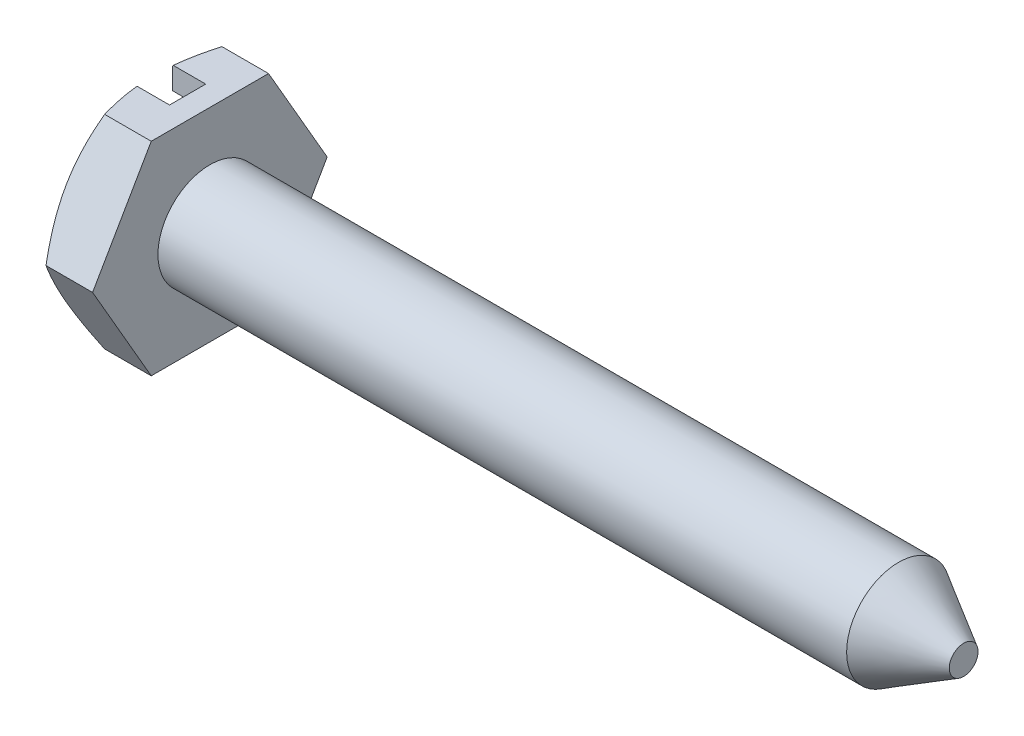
ISO-10303-21;
HEADER;
FILE_DESCRIPTION(('STEP AP214'),'2;1');
FILE_NAME('part.step','',(''),(''),'','','');
FILE_SCHEMA(('AUTOMOTIVE_DESIGN { 1 0 10303 214 1 1 1 1 }'));
ENDSEC;
DATA;
#1=APPLICATION_CONTEXT('core data for automotive mechanical design processes');
#2=APPLICATION_PROTOCOL_DEFINITION('international standard','automotive_design',2000,#1);
#3=PRODUCT_CONTEXT('',#1,'mechanical');
#4=PRODUCT('Part','Part','',(#3));
#5=PRODUCT_RELATED_PRODUCT_CATEGORY('part','',(#4));
#6=PRODUCT_DEFINITION_FORMATION('','',#4);
#7=PRODUCT_DEFINITION_CONTEXT('part definition',#1,'design');
#8=PRODUCT_DEFINITION('design','',#6,#7);
#9=PRODUCT_DEFINITION_SHAPE('','',#8);
#10=(LENGTH_UNIT() NAMED_UNIT(*) SI_UNIT(.MILLI.,.METRE.));
#11=(NAMED_UNIT(*) PLANE_ANGLE_UNIT() SI_UNIT($,.RADIAN.));
#12=(NAMED_UNIT(*) SI_UNIT($,.STERADIAN.) SOLID_ANGLE_UNIT());
#13=UNCERTAINTY_MEASURE_WITH_UNIT(LENGTH_MEASURE(1.E-05),#10,'distance_accuracy_value','');
#14=(GEOMETRIC_REPRESENTATION_CONTEXT(3) GLOBAL_UNCERTAINTY_ASSIGNED_CONTEXT((#13)) GLOBAL_UNIT_ASSIGNED_CONTEXT((#10,
#11,#12)) REPRESENTATION_CONTEXT('',''));
#15=CARTESIAN_POINT('',(0.,0.,0.));
#16=DIRECTION('',(0.,0.,1.));
#17=DIRECTION('',(1.,0.,0.));
#18=AXIS2_PLACEMENT_3D('',#15,#16,#17);
#19=CARTESIAN_POINT('',(0.,0.,0.));
#20=DIRECTION('',(-1.,0.,0.));
#21=DIRECTION('',(0.,0.,1.));
#22=AXIS2_PLACEMENT_3D('',#19,#20,#21);
#23=CYLINDRICAL_SURFACE('',#22,1.4224);
#24=CARTESIAN_POINT('',(0.,0.,0.));
#25=DIRECTION('',(-1.,0.,0.));
#26=DIRECTION('',(0.,0.,1.));
#27=AXIS2_PLACEMENT_3D('',#24,#25,#26);
#28=CIRCLE('',#27,1.4224);
#29=CARTESIAN_POINT('',(0.,0.,1.4224));
#30=VERTEX_POINT('',#29);
#31=EDGE_CURVE('E445',#30,#30,#28,.T.);
#32=ORIENTED_EDGE('',*,*,#31,.F.);
#33=EDGE_LOOP('',(#32));
#34=FACE_BOUND('',#33,.T.);
#35=CARTESIAN_POINT('',(18.8557393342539,0.,0.));
#36=DIRECTION('',(-1.,0.,0.));
#37=DIRECTION('',(0.,0.,1.));
#38=AXIS2_PLACEMENT_3D('',#35,#36,#37);
#39=CIRCLE('',#38,1.4224);
#40=CARTESIAN_POINT('',(18.8557393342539,0.,1.4224));
#41=VERTEX_POINT('',#40);
#42=EDGE_CURVE('E628',#41,#41,#39,.T.);
#43=ORIENTED_EDGE('',*,*,#42,.T.);
#44=EDGE_LOOP('',(#43));
#45=FACE_BOUND('',#44,.T.);
#46=ADVANCED_FACE('F81',(#34,#45),#23,.T.);
#47=CARTESIAN_POINT('',(-0.6096,-2.7813,0.4953));
#48=DIRECTION('',(0.,0.,1.));
#49=DIRECTION('',(1.,0.,0.));
#50=AXIS2_PLACEMENT_3D('',#47,#48,#49);
#51=PLANE('',#50);
#52=DIRECTION('',(-1.,0.,0.));
#53=VECTOR('',#52,1.);
#54=CARTESIAN_POINT('',(0.,2.16921204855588,0.4953));
#55=LINE('',#54,#53);
#56=CARTESIAN_POINT('',(-1.524,2.16921204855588,0.4953));
#57=VERTEX_POINT('',#56);
#58=CARTESIAN_POINT('',(-1.2192,2.16921204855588,0.4953));
#59=VERTEX_POINT('',#58);
#60=EDGE_CURVE('E209',#57,#59,#55,.F.);
#61=ORIENTED_EDGE('',*,*,#60,.F.);
#62=DIRECTION('',(0.,-1.,0.));
#63=VECTOR('',#62,1.);
#64=CARTESIAN_POINT('',(-1.524,2.7813,0.4953));
#65=LINE('',#64,#63);
#66=CARTESIAN_POINT('',(-1.524,2.73684263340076,0.4953));
#67=VERTEX_POINT('',#66);
#68=EDGE_CURVE('E221',#67,#57,#65,.T.);
#69=ORIENTED_EDGE('',*,*,#68,.F.);
#70=CARTESIAN_POINT('',(-2.83951584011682,-0.0862858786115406,0.4953));
#71=CARTESIAN_POINT('',(-2.84181163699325,-0.0633932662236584,0.4953));
#72=CARTESIAN_POINT('',(-2.84318730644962,-0.0404084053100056,0.4953));
#73=CARTESIAN_POINT('',(-2.84410443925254,0.00556449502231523,0.4953));
#74=CARTESIAN_POINT('',(-2.84364857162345,0.0285524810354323,0.4953));
#75=CARTESIAN_POINT('',(-2.84093558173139,0.0740779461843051,0.4953));
#76=CARTESIAN_POINT('',(-2.83870525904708,0.0966170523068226,0.4953));
#77=CARTESIAN_POINT('',(-2.8326528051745,0.141472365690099,0.4953));
#78=CARTESIAN_POINT('',(-2.8288308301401,0.163788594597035,0.4953));
#79=CARTESIAN_POINT('',(-2.81640703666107,0.225017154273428,0.4953));
#80=CARTESIAN_POINT('',(-2.80638094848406,0.263638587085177,0.4953));
#81=CARTESIAN_POINT('',(-2.78343643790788,0.340026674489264,0.4953));
#82=CARTESIAN_POINT('',(-2.77051412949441,0.377792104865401,0.4953));
#83=CARTESIAN_POINT('',(-2.7427005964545,0.452776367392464,0.4953));
#84=CARTESIAN_POINT('',(-2.72780062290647,0.489991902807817,0.4953));
#85=CARTESIAN_POINT('',(-2.69672595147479,0.563856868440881,0.4953));
#86=CARTESIAN_POINT('',(-2.68055191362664,0.600506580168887,0.4953));
#87=CARTESIAN_POINT('',(-2.64666056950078,0.674866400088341,0.4953));
#88=CARTESIAN_POINT('',(-2.62890737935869,0.712560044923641,0.4953));
#89=CARTESIAN_POINT('',(-2.59273785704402,0.787628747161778,0.4953));
#90=CARTESIAN_POINT('',(-2.57432148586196,0.825003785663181,0.4953));
#91=CARTESIAN_POINT('',(-2.51848066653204,0.936558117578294,0.4953));
#92=CARTESIAN_POINT('',(-2.48036048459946,1.01038814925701,0.4953));
#93=CARTESIAN_POINT('',(-2.40373336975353,1.15629246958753,0.4953));
#94=CARTESIAN_POINT('',(-2.36524317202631,1.22837563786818,0.4953));
#95=CARTESIAN_POINT('',(-2.28763926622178,1.37220756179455,0.4953));
#96=CARTESIAN_POINT('',(-2.24852554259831,1.44395630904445,0.4953));
#97=CARTESIAN_POINT('',(-2.1305835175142,1.65888463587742,0.4953));
#98=CARTESIAN_POINT('',(-2.05115956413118,1.80173656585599,0.4953));
#99=CARTESIAN_POINT('',(-1.89143009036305,2.08720749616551,0.4953));
#100=CARTESIAN_POINT('',(-1.81112349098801,2.22982588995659,0.4953));
#101=CARTESIAN_POINT('',(-1.65006480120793,2.51480357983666,0.4953));
#102=CARTESIAN_POINT('',(-1.56931272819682,2.65716288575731,0.4953));
#103=CARTESIAN_POINT('',(-1.41917076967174,2.92125266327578,0.4953));
#104=CARTESIAN_POINT('',(-1.34981779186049,3.0430041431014,0.4953));
#105=CARTESIAN_POINT('',(-1.21096785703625,3.28642693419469,0.4953));
#106=CARTESIAN_POINT('',(-1.14147089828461,3.4080982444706,0.4953));
#107=CARTESIAN_POINT('',(-1.00247417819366,3.65120645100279,0.4953));
#108=CARTESIAN_POINT('',(-0.932974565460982,3.77264343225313,0.4953));
#109=CARTESIAN_POINT('',(-0.793897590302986,4.01547078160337,0.4953));
#110=CARTESIAN_POINT('',(-0.724320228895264,4.13686115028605,0.4953));
#111=CARTESIAN_POINT('',(-0.654715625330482,4.25823587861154,0.4953));
#112=B_SPLINE_CURVE_WITH_KNOTS('',3,(#70,#71,#72,#73,#74,#75,#76,#77,#78,#79,#80,#81,#82,#83,
#84,#85,#86,#87,#88,#89,#90,#91,#92,#93,#94,#95,#96,#97,#98,#99,#100,#101,#102,#103,#104,#105,
#106,#107,#108,#109,#110,#111),.UNSPECIFIED.,.F.,.F.,(4,2,2,2,2,2,2,2,2,2,2,2,2,2,2,2,2,2,2,2,
4),(0.,0.0690044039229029,0.137908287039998,0.205790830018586,0.273666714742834,
0.393183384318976,0.512861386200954,0.633087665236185,0.753252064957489,0.8782383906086,
1.00323208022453,1.25248552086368,1.49762998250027,1.74278056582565,2.23311484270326,
2.72413593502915,3.21513798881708,3.63549409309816,4.05585530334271,4.47561023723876,
4.89535974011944),.UNSPECIFIED.);
#113=CARTESIAN_POINT('',(-1.49873640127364,2.7813,0.4953));
#114=VERTEX_POINT('',#113);
#115=EDGE_CURVE('E327',#67,#114,#112,.T.);
#116=ORIENTED_EDGE('',*,*,#115,.T.);
#117=DIRECTION('',(-1.,0.,0.));
#118=VECTOR('',#117,1.);
#119=CARTESIAN_POINT('',(-0.6096,2.7813,0.4953));
#120=LINE('',#119,#118);
#121=CARTESIAN_POINT('',(-0.6096,2.7813,0.4953));
#122=VERTEX_POINT('',#121);
#123=EDGE_CURVE('E288',#122,#114,#120,.T.);
#124=ORIENTED_EDGE('',*,*,#123,.F.);
#125=DIRECTION('',(0.,1.,0.));
#126=VECTOR('',#125,1.);
#127=CARTESIAN_POINT('',(-0.6096,-2.7813,0.4953));
#128=LINE('',#127,#126);
#129=CARTESIAN_POINT('',(-0.6096,-2.7813,0.4953));
#130=VERTEX_POINT('',#129);
#131=EDGE_CURVE('E275',#130,#122,#128,.T.);
#132=ORIENTED_EDGE('',*,*,#131,.F.);
#133=DIRECTION('',(-1.,0.,0.));
#134=VECTOR('',#133,1.);
#135=CARTESIAN_POINT('',(-0.6096,-2.7813,0.4953));
#136=LINE('',#135,#134);
#137=CARTESIAN_POINT('',(-1.49873640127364,-2.7813,0.4953));
#138=VERTEX_POINT('',#137);
#139=EDGE_CURVE('E287',#130,#138,#136,.T.);
#140=ORIENTED_EDGE('',*,*,#139,.T.);
#141=CARTESIAN_POINT('',(-0.661468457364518,-4.24646055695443,0.4953));
#142=CARTESIAN_POINT('',(-0.778480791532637,-4.04237436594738,0.4953));
#143=CARTESIAN_POINT('',(-0.895440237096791,-3.8382574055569,0.4953));
#144=CARTESIAN_POINT('',(-1.12909036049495,-3.42984774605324,0.4953));
#145=CARTESIAN_POINT('',(-1.24578101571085,-3.22555503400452,0.4953));
#146=CARTESIAN_POINT('',(-1.47737015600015,-2.8190671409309,0.4953));
#147=CARTESIAN_POINT('',(-1.59227380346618,-2.61687490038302,0.4953));
#148=CARTESIAN_POINT('',(-1.82126101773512,-2.21204180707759,0.4953));
#149=CARTESIAN_POINT('',(-1.93534463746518,-2.00940098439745,0.4953));
#150=CARTESIAN_POINT('',(-2.09695482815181,-1.71912566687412,0.4953));
#151=CARTESIAN_POINT('',(-2.14526845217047,-1.63193028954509,0.4953));
#152=CARTESIAN_POINT('',(-2.24132676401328,-1.45721192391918,0.4953));
#153=CARTESIAN_POINT('',(-2.28907137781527,-1.36968889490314,0.4953));
#154=CARTESIAN_POINT('',(-2.38396710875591,-1.19350160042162,0.4953));
#155=CARTESIAN_POINT('',(-2.43111145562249,-1.10483365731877,0.4953));
#156=CARTESIAN_POINT('',(-2.50047993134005,-0.971144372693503,0.4953));
#157=CARTESIAN_POINT('',(-2.5233753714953,-0.926472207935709,0.4953));
#158=CARTESIAN_POINT('',(-2.56851466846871,-0.836800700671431,0.4953));
#159=CARTESIAN_POINT('',(-2.5907585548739,-0.791801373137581,0.4953));
#160=CARTESIAN_POINT('',(-2.63241940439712,-0.705206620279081,0.4953));
#161=CARTESIAN_POINT('',(-2.65191539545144,-0.663649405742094,0.4953));
#162=CARTESIAN_POINT('',(-2.68970979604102,-0.579963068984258,0.4953));
#163=CARTESIAN_POINT('',(-2.70800762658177,-0.537833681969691,0.4953));
#164=CARTESIAN_POINT('',(-2.74252768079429,-0.453285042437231,0.4953));
#165=CARTESIAN_POINT('',(-2.75877123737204,-0.410874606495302,0.4953));
#166=CARTESIAN_POINT('',(-2.78832408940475,-0.325037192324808,0.4953));
#167=CARTESIAN_POINT('',(-2.80163595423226,-0.281611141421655,0.4953));
#168=CARTESIAN_POINT('',(-2.81891829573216,-0.212376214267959,0.4953));
#169=CARTESIAN_POINT('',(-2.82445043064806,-0.18696239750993,0.4953));
#170=CARTESIAN_POINT('',(-2.83360220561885,-0.135800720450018,0.4953));
#171=CARTESIAN_POINT('',(-2.83722314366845,-0.11005309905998,0.4953));
#172=CARTESIAN_POINT('',(-2.84226342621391,-0.0578667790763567,0.4953));
#173=CARTESIAN_POINT('',(-2.84364179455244,-0.0314240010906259,0.4953));
#174=CARTESIAN_POINT('',(-2.84397526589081,0.0215503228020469,0.4953));
#175=CARTESIAN_POINT('',(-2.84292349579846,0.0480819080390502,0.4953));
#176=CARTESIAN_POINT('',(-2.84060505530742,0.0745105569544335,0.4953));
#177=B_SPLINE_CURVE_WITH_KNOTS('',3,(#141,#142,#143,#144,#145,#146,#147,#148,#149,#150,#151,
#152,#153,#154,#155,#156,#157,#158,#159,#160,#161,#162,#163,#164,#165,#166,#167,#168,#169,#170,
#171,#172,#173,#174,#175,#176),.UNSPECIFIED.,.F.,.F.,(4,2,2,2,2,2,2,2,2,2,2,2,2,2,2,2,2,4),(0.,
0.705753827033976,1.41156501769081,2.1092473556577,2.80688425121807,3.10593979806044,
3.4050338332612,3.70628648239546,3.85687606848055,4.00745880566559,4.14515661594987,
4.28292048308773,4.41910977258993,4.5551792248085,4.6331486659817,4.7110650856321,
4.79038982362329,4.86993918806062),.UNSPECIFIED.);
#178=CARTESIAN_POINT('',(-1.524,-2.73684263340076,0.4953));
#179=VERTEX_POINT('',#178);
#180=EDGE_CURVE('E337',#138,#179,#177,.T.);
#181=ORIENTED_EDGE('',*,*,#180,.T.);
#182=CARTESIAN_POINT('',(-1.524,-2.16921204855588,0.4953));
#183=VERTEX_POINT('',#182);
#184=EDGE_CURVE('E231',#183,#179,#65,.T.);
#185=ORIENTED_EDGE('',*,*,#184,.F.);
#186=DIRECTION('',(-1.,0.,0.));
#187=VECTOR('',#186,1.);
#188=CARTESIAN_POINT('',(0.,-2.16921204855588,0.4953));
#189=LINE('',#188,#187);
#190=CARTESIAN_POINT('',(-1.2192,-2.16921204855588,0.4953));
#191=VERTEX_POINT('',#190);
#192=EDGE_CURVE('E213',#191,#183,#189,.T.);
#193=ORIENTED_EDGE('',*,*,#192,.F.);
#194=DIRECTION('',(0.,-1.,0.));
#195=VECTOR('',#194,1.);
#196=CARTESIAN_POINT('',(-1.2192,-2.7813,0.4953));
#197=LINE('',#196,#195);
#198=EDGE_CURVE('E223',#59,#191,#197,.T.);
#199=ORIENTED_EDGE('',*,*,#198,.F.);
#200=EDGE_LOOP('',(#61,#69,#116,#124,#132,#140,#181,#185,#193,#199));
#201=FACE_BOUND('',#200,.T.);
#202=ADVANCED_FACE('F217',(#201),#51,.F.);
#203=CARTESIAN_POINT('',(-0.6096,-2.7813,-0.4953));
#204=DIRECTION('',(0.,0.,-1.));
#205=DIRECTION('',(-1.,0.,0.));
#206=AXIS2_PLACEMENT_3D('',#203,#204,#205);
#207=PLANE('',#206);
#208=DIRECTION('',(-1.,0.,0.));
#209=VECTOR('',#208,1.);
#210=CARTESIAN_POINT('',(0.,-2.16921204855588,-0.4953));
#211=LINE('',#210,#209);
#212=CARTESIAN_POINT('',(-1.524,-2.16921204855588,-0.4953));
#213=VERTEX_POINT('',#212);
#214=CARTESIAN_POINT('',(-1.2192,-2.16921204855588,-0.4953));
#215=VERTEX_POINT('',#214);
#216=EDGE_CURVE('E55',#213,#215,#211,.F.);
#217=ORIENTED_EDGE('',*,*,#216,.F.);
#218=DIRECTION('',(0.,1.,0.));
#219=VECTOR('',#218,1.);
#220=CARTESIAN_POINT('',(-1.524,2.7813,-0.4953));
#221=LINE('',#220,#219);
#222=CARTESIAN_POINT('',(-1.524,-2.73684263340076,-0.4953));
#223=VERTEX_POINT('',#222);
#224=EDGE_CURVE('E241',#223,#213,#221,.T.);
#225=ORIENTED_EDGE('',*,*,#224,.F.);
#226=CARTESIAN_POINT('',(-2.83951584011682,0.0862858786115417,-0.4953));
#227=CARTESIAN_POINT('',(-2.84181163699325,0.0633932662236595,-0.4953));
#228=CARTESIAN_POINT('',(-2.84318730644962,0.0404084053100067,-0.4953));
#229=CARTESIAN_POINT('',(-2.84410443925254,-0.00556449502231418,-0.4953));
#230=CARTESIAN_POINT('',(-2.84364857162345,-0.0285524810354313,-0.4953));
#231=CARTESIAN_POINT('',(-2.84093558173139,-0.0740779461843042,-0.4953));
#232=CARTESIAN_POINT('',(-2.83870525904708,-0.0966170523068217,-0.4953));
#233=CARTESIAN_POINT('',(-2.8326528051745,-0.141472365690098,-0.4953));
#234=CARTESIAN_POINT('',(-2.8288308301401,-0.163788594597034,-0.4953));
#235=CARTESIAN_POINT('',(-2.81640703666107,-0.225017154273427,-0.4953));
#236=CARTESIAN_POINT('',(-2.80638094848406,-0.263638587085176,-0.4953));
#237=CARTESIAN_POINT('',(-2.78343643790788,-0.340026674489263,-0.4953));
#238=CARTESIAN_POINT('',(-2.77051412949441,-0.377792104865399,-0.4953));
#239=CARTESIAN_POINT('',(-2.7427005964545,-0.452776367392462,-0.4953));
#240=CARTESIAN_POINT('',(-2.72780062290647,-0.489991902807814,-0.4953));
#241=CARTESIAN_POINT('',(-2.6967259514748,-0.563856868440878,-0.4953));
#242=CARTESIAN_POINT('',(-2.68055191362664,-0.600506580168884,-0.4953));
#243=CARTESIAN_POINT('',(-2.64666056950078,-0.674866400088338,-0.4953));
#244=CARTESIAN_POINT('',(-2.62890737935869,-0.712560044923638,-0.4953));
#245=CARTESIAN_POINT('',(-2.59273785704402,-0.787628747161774,-0.4953));
#246=CARTESIAN_POINT('',(-2.57432148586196,-0.825003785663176,-0.4953));
#247=CARTESIAN_POINT('',(-2.51848066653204,-0.936558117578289,-0.4953));
#248=CARTESIAN_POINT('',(-2.48036048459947,-1.01038814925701,-0.4953));
#249=CARTESIAN_POINT('',(-2.40373336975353,-1.15629246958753,-0.4953));
#250=CARTESIAN_POINT('',(-2.36524317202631,-1.22837563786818,-0.4953));
#251=CARTESIAN_POINT('',(-2.28763926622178,-1.37220756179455,-0.4953));
#252=CARTESIAN_POINT('',(-2.24852554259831,-1.44395630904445,-0.4953));
#253=CARTESIAN_POINT('',(-2.1305835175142,-1.65888463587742,-0.4953));
#254=CARTESIAN_POINT('',(-2.05115956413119,-1.80173656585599,-0.4953));
#255=CARTESIAN_POINT('',(-1.89143009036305,-2.0872074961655,-0.4953));
#256=CARTESIAN_POINT('',(-1.81112349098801,-2.22982588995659,-0.4953));
#257=CARTESIAN_POINT('',(-1.65006480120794,-2.51480357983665,-0.4953));
#258=CARTESIAN_POINT('',(-1.56931272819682,-2.65716288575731,-0.4953));
#259=CARTESIAN_POINT('',(-1.41917076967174,-2.92125266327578,-0.4953));
#260=CARTESIAN_POINT('',(-1.34981779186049,-3.0430041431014,-0.4953));
#261=CARTESIAN_POINT('',(-1.21096785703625,-3.28642693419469,-0.4953));
#262=CARTESIAN_POINT('',(-1.14147089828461,-3.4080982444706,-0.4953));
#263=CARTESIAN_POINT('',(-1.00247417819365,-3.65120645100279,-0.4953));
#264=CARTESIAN_POINT('',(-0.932974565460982,-3.77264343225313,-0.4953));
#265=CARTESIAN_POINT('',(-0.793897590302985,-4.01547078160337,-0.4953));
#266=CARTESIAN_POINT('',(-0.724320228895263,-4.13686115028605,-0.4953));
#267=CARTESIAN_POINT('',(-0.654715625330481,-4.25823587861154,-0.4953));
#268=B_SPLINE_CURVE_WITH_KNOTS('',3,(#226,#227,#228,#229,#230,#231,#232,#233,#234,#235,#236,
#237,#238,#239,#240,#241,#242,#243,#244,#245,#246,#247,#248,#249,#250,#251,#252,#253,#254,#255,
#256,#257,#258,#259,#260,#261,#262,#263,#264,#265,#266,#267),.UNSPECIFIED.,.F.,.F.,(4,2,2,2,2,2,
2,2,2,2,2,2,2,2,2,2,2,2,2,2,4),(0.,0.069004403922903,0.137908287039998,0.205790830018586,
0.273666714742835,0.393183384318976,0.512861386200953,0.633087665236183,0.753252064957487,
0.878238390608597,1.00323208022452,1.25248552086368,1.49762998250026,1.74278056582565,
2.23311484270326,2.72413593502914,3.21513798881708,3.63549409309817,4.05585530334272,
4.47561023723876,4.89535974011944),.UNSPECIFIED.);
#269=CARTESIAN_POINT('',(-1.49873640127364,-2.7813,-0.4953));
#270=VERTEX_POINT('',#269);
#271=EDGE_CURVE('E311',#223,#270,#268,.T.);
#272=ORIENTED_EDGE('',*,*,#271,.T.);
#273=DIRECTION('',(-1.,0.,0.));
#274=VECTOR('',#273,1.);
#275=CARTESIAN_POINT('',(-0.6096,-2.7813,-0.4953));
#276=LINE('',#275,#274);
#277=CARTESIAN_POINT('',(-0.6096,-2.7813,-0.4953));
#278=VERTEX_POINT('',#277);
#279=EDGE_CURVE('E291',#278,#270,#276,.T.);
#280=ORIENTED_EDGE('',*,*,#279,.F.);
#281=DIRECTION('',(0.,-1.,0.));
#282=VECTOR('',#281,1.);
#283=CARTESIAN_POINT('',(-0.6096,-2.7813,-0.4953));
#284=LINE('',#283,#282);
#285=CARTESIAN_POINT('',(-0.6096,2.7813,-0.4953));
#286=VERTEX_POINT('',#285);
#287=EDGE_CURVE('E277',#286,#278,#284,.T.);
#288=ORIENTED_EDGE('',*,*,#287,.F.);
#289=DIRECTION('',(-1.,0.,0.));
#290=VECTOR('',#289,1.);
#291=CARTESIAN_POINT('',(-0.6096,2.7813,-0.4953));
#292=LINE('',#291,#290);
#293=CARTESIAN_POINT('',(-1.49873640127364,2.7813,-0.4953));
#294=VERTEX_POINT('',#293);
#295=EDGE_CURVE('E300',#286,#294,#292,.T.);
#296=ORIENTED_EDGE('',*,*,#295,.T.);
#297=CARTESIAN_POINT('',(-0.661468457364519,4.24646055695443,-0.4953));
#298=CARTESIAN_POINT('',(-0.778480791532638,4.04237436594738,-0.4953));
#299=CARTESIAN_POINT('',(-0.895440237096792,3.8382574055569,-0.4953));
#300=CARTESIAN_POINT('',(-1.12909036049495,3.42984774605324,-0.4953));
#301=CARTESIAN_POINT('',(-1.24578101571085,3.22555503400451,-0.4953));
#302=CARTESIAN_POINT('',(-1.47737015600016,2.8190671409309,-0.4953));
#303=CARTESIAN_POINT('',(-1.59227380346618,2.61687490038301,-0.4953));
#304=CARTESIAN_POINT('',(-1.82126101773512,2.21204180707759,-0.4953));
#305=CARTESIAN_POINT('',(-1.93534463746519,2.00940098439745,-0.4953));
#306=CARTESIAN_POINT('',(-2.09695482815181,1.71912566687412,-0.4953));
#307=CARTESIAN_POINT('',(-2.14526845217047,1.63193028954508,-0.4953));
#308=CARTESIAN_POINT('',(-2.24132676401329,1.45721192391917,-0.4953));
#309=CARTESIAN_POINT('',(-2.28907137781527,1.36968889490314,-0.4953));
#310=CARTESIAN_POINT('',(-2.38396710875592,1.19350160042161,-0.4953));
#311=CARTESIAN_POINT('',(-2.43111145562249,1.10483365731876,-0.4953));
#312=CARTESIAN_POINT('',(-2.50047993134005,0.971144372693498,-0.4953));
#313=CARTESIAN_POINT('',(-2.5233753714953,0.926472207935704,-0.4953));
#314=CARTESIAN_POINT('',(-2.56851466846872,0.836800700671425,-0.4953));
#315=CARTESIAN_POINT('',(-2.5907585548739,0.791801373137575,-0.4953));
#316=CARTESIAN_POINT('',(-2.63241940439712,0.705206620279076,-0.4953));
#317=CARTESIAN_POINT('',(-2.65191539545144,0.663649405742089,-0.4953));
#318=CARTESIAN_POINT('',(-2.68970979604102,0.579963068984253,-0.4953));
#319=CARTESIAN_POINT('',(-2.70800762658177,0.537833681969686,-0.4953));
#320=CARTESIAN_POINT('',(-2.7425276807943,0.453285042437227,-0.4953));
#321=CARTESIAN_POINT('',(-2.75877123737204,0.410874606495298,-0.4953));
#322=CARTESIAN_POINT('',(-2.78832408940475,0.325037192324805,-0.4953));
#323=CARTESIAN_POINT('',(-2.80163595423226,0.281611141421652,-0.4953));
#324=CARTESIAN_POINT('',(-2.81891829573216,0.212376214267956,-0.4953));
#325=CARTESIAN_POINT('',(-2.82445043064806,0.186962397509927,-0.4953));
#326=CARTESIAN_POINT('',(-2.83360220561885,0.135800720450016,-0.4953));
#327=CARTESIAN_POINT('',(-2.83722314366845,0.110053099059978,-0.4953));
#328=CARTESIAN_POINT('',(-2.84226342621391,0.0578667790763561,-0.4953));
#329=CARTESIAN_POINT('',(-2.84364179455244,0.0314240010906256,-0.4953));
#330=CARTESIAN_POINT('',(-2.84397526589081,-0.0215503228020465,-0.4953));
#331=CARTESIAN_POINT('',(-2.84292349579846,-0.0480819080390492,-0.4953));
#332=CARTESIAN_POINT('',(-2.84060505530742,-0.074510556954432,-0.4953));
#333=B_SPLINE_CURVE_WITH_KNOTS('',3,(#297,#298,#299,#300,#301,#302,#303,#304,#305,#306,#307,
#308,#309,#310,#311,#312,#313,#314,#315,#316,#317,#318,#319,#320,#321,#322,#323,#324,#325,#326,
#327,#328,#329,#330,#331,#332),.UNSPECIFIED.,.F.,.F.,(4,2,2,2,2,2,2,2,2,2,2,2,2,2,2,2,2,4),(0.,
0.705753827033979,1.41156501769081,2.1092473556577,2.80688425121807,3.10593979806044,
3.4050338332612,3.70628648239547,3.85687606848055,4.00745880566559,4.14515661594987,
4.28292048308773,4.41910977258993,4.5551792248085,4.6331486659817,4.7110650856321,
4.79038982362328,4.86993918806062),.UNSPECIFIED.);
#334=CARTESIAN_POINT('',(-1.524,2.73684263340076,-0.4953));
#335=VERTEX_POINT('',#334);
#336=EDGE_CURVE('E292',#294,#335,#333,.T.);
#337=ORIENTED_EDGE('',*,*,#336,.T.);
#338=CARTESIAN_POINT('',(-1.524,2.16921204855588,-0.4953));
#339=VERTEX_POINT('',#338);
#340=EDGE_CURVE('E260',#339,#335,#221,.T.);
#341=ORIENTED_EDGE('',*,*,#340,.F.);
#342=DIRECTION('',(-1.,0.,0.));
#343=VECTOR('',#342,1.);
#344=CARTESIAN_POINT('',(0.,2.16921204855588,-0.4953));
#345=LINE('',#344,#343);
#346=CARTESIAN_POINT('',(-1.2192,2.16921204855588,-0.4953));
#347=VERTEX_POINT('',#346);
#348=EDGE_CURVE('E235',#347,#339,#345,.T.);
#349=ORIENTED_EDGE('',*,*,#348,.F.);
#350=DIRECTION('',(0.,1.,0.));
#351=VECTOR('',#350,1.);
#352=CARTESIAN_POINT('',(-1.2192,-2.7813,-0.4953));
#353=LINE('',#352,#351);
#354=EDGE_CURVE('E95',#215,#347,#353,.T.);
#355=ORIENTED_EDGE('',*,*,#354,.F.);
#356=EDGE_LOOP('',(#217,#225,#272,#280,#288,#296,#337,#341,#349,#355));
#357=FACE_BOUND('',#356,.T.);
#358=ADVANCED_FACE('F253',(#357),#207,.F.);
#359=CARTESIAN_POINT('',(-1.524,2.7813,0.));
#360=DIRECTION('',(1.,0.,0.));
#361=DIRECTION('',(0.,0.,-1.));
#362=AXIS2_PLACEMENT_3D('',#359,#360,#361);
#363=PLANE('',#362);
#364=CARTESIAN_POINT('',(-1.524,0.,0.));
#365=DIRECTION('',(-1.,0.,0.));
#366=DIRECTION('',(0.,0.,1.));
#367=AXIS2_PLACEMENT_3D('',#364,#365,#366);
#368=CIRCLE('',#367,2.22504);
#369=EDGE_CURVE('E207',#183,#57,#368,.T.);
#370=ORIENTED_EDGE('',*,*,#369,.F.);
#371=ORIENTED_EDGE('',*,*,#184,.T.);
#372=CARTESIAN_POINT('',(-1.524,0.,0.));
#373=DIRECTION('',(1.,0.,0.));
#374=DIRECTION('',(0.,0.,-1.));
#375=AXIS2_PLACEMENT_3D('',#372,#373,#374);
#376=CIRCLE('',#375,2.7813);
#377=CARTESIAN_POINT('',(-1.524,-1.39065,2.40867645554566));
#378=VERTEX_POINT('',#377);
#379=EDGE_CURVE('E446',#378,#179,#376,.T.);
#380=ORIENTED_EDGE('',*,*,#379,.F.);
#381=CARTESIAN_POINT('',(-1.524,1.39065,2.40867645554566));
#382=VERTEX_POINT('',#381);
#383=EDGE_CURVE('E459',#382,#378,#376,.T.);
#384=ORIENTED_EDGE('',*,*,#383,.F.);
#385=CARTESIAN_POINT('',(-1.524,0.,0.));
#386=DIRECTION('',(-1.,0.,0.));
#387=DIRECTION('',(0.,0.,1.));
#388=AXIS2_PLACEMENT_3D('',#385,#386,#387);
#389=CIRCLE('',#388,2.7813);
#390=EDGE_CURVE('E229',#382,#67,#389,.T.);
#391=ORIENTED_EDGE('',*,*,#390,.T.);
#392=ORIENTED_EDGE('',*,*,#68,.T.);
#393=EDGE_LOOP('',(#370,#371,#380,#384,#391,#392));
#394=FACE_BOUND('',#393,.T.);
#395=ADVANCED_FACE('F227',(#394),#363,.F.);
#396=CARTESIAN_POINT('',(8.49701185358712,2.7813,1.60578430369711));
#397=DIRECTION('',(0.,1.,0.));
#398=DIRECTION('',(0.,0.,1.));
#399=AXIS2_PLACEMENT_3D('',#396,#397,#398);
#400=PLANE('',#399);
#401=ORIENTED_EDGE('',*,*,#123,.T.);
#402=CARTESIAN_POINT('',(0.254962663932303,2.7813,-5.16080482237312));
#403=CARTESIAN_POINT('',(0.193180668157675,2.7813,-5.03922701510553));
#404=CARTESIAN_POINT('',(0.131774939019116,2.7813,-4.91745616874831));
#405=CARTESIAN_POINT('',(0.00990240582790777,2.7813,-4.67344214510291));
#406=CARTESIAN_POINT('',(-0.0505643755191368,2.7813,-4.55119895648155));
#407=CARTESIAN_POINT('',(-0.170477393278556,2.7813,-4.30593942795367));
#408=CARTESIAN_POINT('',(-0.229921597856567,2.7813,-4.1829220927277));
#409=CARTESIAN_POINT('',(-0.347422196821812,2.7813,-3.93622304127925));
#410=CARTESIAN_POINT('',(-0.405478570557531,2.7813,-3.81254131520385));
#411=CARTESIAN_POINT('',(-0.522691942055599,2.7813,-3.55827357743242));
#412=CARTESIAN_POINT('',(-0.581762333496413,2.7813,-3.42764751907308));
#413=CARTESIAN_POINT('',(-0.697511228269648,2.7813,-3.16534098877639));
#414=CARTESIAN_POINT('',(-0.754189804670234,2.7813,-3.03366054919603));
#415=CARTESIAN_POINT('',(-0.864448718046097,2.7813,-2.76911270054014));
#416=CARTESIAN_POINT('',(-0.918031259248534,2.7813,-2.63624621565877));
#417=CARTESIAN_POINT('',(-1.02125723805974,2.7813,-2.36894528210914));
#418=CARTESIAN_POINT('',(-1.07089966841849,2.7813,-2.23451044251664));
#419=CARTESIAN_POINT('',(-1.17424203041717,2.7813,-1.9373961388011));
#420=CARTESIAN_POINT('',(-1.22684147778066,2.7813,-1.77432725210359));
#421=CARTESIAN_POINT('',(-1.32199092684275,2.7813,-1.4453265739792));
#422=CARTESIAN_POINT('',(-1.36454643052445,2.7813,-1.2793964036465));
#423=CARTESIAN_POINT('',(-1.43564260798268,2.7813,-0.947577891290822));
#424=CARTESIAN_POINT('',(-1.46442275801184,2.7813,-0.781743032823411));
#425=CARTESIAN_POINT('',(-1.49561701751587,2.7813,-0.53154445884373));
#426=CARTESIAN_POINT('',(-1.50401893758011,2.7813,-0.447909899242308));
#427=CARTESIAN_POINT('',(-1.51657617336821,2.7813,-0.280327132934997));
#428=CARTESIAN_POINT('',(-1.52073208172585,2.7813,-0.196378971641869));
#429=CARTESIAN_POINT('',(-1.5246669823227,2.7813,-0.0275394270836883));
#430=CARTESIAN_POINT('',(-1.52440184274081,2.7813,0.0573530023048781));
#431=CARTESIAN_POINT('',(-1.51940478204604,2.7813,0.226999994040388));
#432=CARTESIAN_POINT('',(-1.51467283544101,2.7813,0.311754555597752));
#433=CARTESIAN_POINT('',(-1.49398621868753,2.7813,0.565530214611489));
#434=CARTESIAN_POINT('',(-1.47154047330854,2.7813,0.734048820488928));
#435=CARTESIAN_POINT('',(-1.41150886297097,2.7813,1.07153784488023));
#436=CARTESIAN_POINT('',(-1.37364391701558,2.7813,1.24045621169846));
#437=CARTESIAN_POINT('',(-1.28635717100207,2.7813,1.57523912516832));
#438=CARTESIAN_POINT('',(-1.23693346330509,2.7813,1.74110316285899));
#439=CARTESIAN_POINT('',(-1.13604586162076,2.7813,2.0502657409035));
#440=CARTESIAN_POINT('',(-1.08553917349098,2.7813,2.19388285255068));
#441=CARTESIAN_POINT('',(-0.979549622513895,2.7813,2.47928137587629));
#442=CARTESIAN_POINT('',(-0.924065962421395,2.7813,2.62106248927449));
#443=CARTESIAN_POINT('',(-0.809288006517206,2.7813,2.90318751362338));
#444=CARTESIAN_POINT('',(-0.749990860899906,2.7813,3.04353025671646));
#445=CARTESIAN_POINT('',(-0.628502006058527,2.7813,3.32295875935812));
#446=CARTESIAN_POINT('',(-0.566310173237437,2.7813,3.46204446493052));
#447=CARTESIAN_POINT('',(-0.442843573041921,2.7813,3.73226359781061));
#448=CARTESIAN_POINT('',(-0.38167819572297,2.7813,3.86344719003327));
#449=CARTESIAN_POINT('',(-0.257729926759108,2.7813,4.12505034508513));
#450=CARTESIAN_POINT('',(-0.194946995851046,2.7813,4.25546988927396));
#451=CARTESIAN_POINT('',(-0.0682407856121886,2.7813,4.51534707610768));
#452=CARTESIAN_POINT('',(-0.00432076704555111,2.7813,4.64480631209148));
#453=CARTESIAN_POINT('',(0.124580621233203,2.7813,4.90318378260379));
#454=CARTESIAN_POINT('',(0.189561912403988,2.7813,5.03210205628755));
#455=CARTESIAN_POINT('',(0.254962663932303,2.7813,5.16080482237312));
#456=B_SPLINE_CURVE_WITH_KNOTS('',3,(#402,#403,#404,#405,#406,#407,#408,#409,#410,#411,#412,
#413,#414,#415,#416,#417,#418,#419,#420,#421,#422,#423,#424,#425,#426,#427,#428,#429,#430,#431,
#432,#433,#434,#435,#436,#437,#438,#439,#440,#441,#442,#443,#444,#445,#446,#447,#448,#449,#450,
#451,#452,#453,#454,#455),.UNSPECIFIED.,.F.,.F.,(4,2,2,2,2,2,2,2,2,2,2,2,2,2,2,2,2,2,2,2,2,2,2,
2,2,2,4),(0.,0.409127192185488,0.818264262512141,1.22813742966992,1.63801669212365,
2.06808185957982,2.49813387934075,2.92787585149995,3.35772733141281,3.87151333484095,
4.38501723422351,4.88923702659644,5.14131099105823,5.39334976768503,5.64790594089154,
5.90246356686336,6.41162201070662,6.93043741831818,7.44933851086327,7.90594601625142,
8.36262679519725,8.81965290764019,9.27669855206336,9.71091229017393,10.1451365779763,
10.5782700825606,11.0113716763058),.UNSPECIFIED.);
#457=CARTESIAN_POINT('',(-1.27558430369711,2.7813,1.60578430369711));
#458=VERTEX_POINT('',#457);
#459=EDGE_CURVE('E378',#114,#458,#456,.T.);
#460=ORIENTED_EDGE('',*,*,#459,.T.);
#461=DIRECTION('',(-1.,0.,0.));
#462=VECTOR('',#461,1.);
#463=CARTESIAN_POINT('',(8.49701185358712,2.7813,1.60578430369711));
#464=LINE('',#463,#462);
#465=CARTESIAN_POINT('',(0.,2.7813,1.60578430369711));
#466=VERTEX_POINT('',#465);
#467=EDGE_CURVE('E399',#466,#458,#464,.T.);
#468=ORIENTED_EDGE('',*,*,#467,.F.);
#469=DIRECTION('',(0.,0.,1.));
#470=VECTOR('',#469,1.);
#471=CARTESIAN_POINT('',(0.,2.7813,1.60578430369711));
#472=LINE('',#471,#470);
#473=CARTESIAN_POINT('',(0.,2.7813,-1.60578430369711));
#474=VERTEX_POINT('',#473);
#475=EDGE_CURVE('E415',#474,#466,#472,.T.);
#476=ORIENTED_EDGE('',*,*,#475,.F.);
#477=DIRECTION('',(-1.,0.,0.));
#478=VECTOR('',#477,1.);
#479=CARTESIAN_POINT('',(8.49701185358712,2.7813,-1.60578430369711));
#480=LINE('',#479,#478);
#481=CARTESIAN_POINT('',(-1.27558430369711,2.7813,-1.60578430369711));
#482=VERTEX_POINT('',#481);
#483=EDGE_CURVE('E434',#474,#482,#480,.T.);
#484=ORIENTED_EDGE('',*,*,#483,.T.);
#485=EDGE_CURVE('E390',#482,#294,#456,.T.);
#486=ORIENTED_EDGE('',*,*,#485,.T.);
#487=ORIENTED_EDGE('',*,*,#295,.F.);
#488=DIRECTION('',(0.,0.,-1.));
#489=VECTOR('',#488,1.);
#490=CARTESIAN_POINT('',(-0.6096,2.7813,-0.4953));
#491=LINE('',#490,#489);
#492=EDGE_CURVE('E278',#122,#286,#491,.T.);
#493=ORIENTED_EDGE('',*,*,#492,.F.);
#494=EDGE_LOOP('',(#401,#460,#468,#476,#484,#486,#487,#493));
#495=FACE_BOUND('',#494,.T.);
#496=ADVANCED_FACE('F371',(#495),#400,.T.);
#497=CARTESIAN_POINT('',(8.49701185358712,0.,3.21156860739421));
#498=DIRECTION('',(0.,0.5,0.866025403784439));
#499=DIRECTION('',(0.,-0.866025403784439,0.5));
#500=AXIS2_PLACEMENT_3D('',#497,#498,#499);
#501=PLANE('',#500);
#502=ORIENTED_EDGE('',*,*,#467,.T.);
#503=CARTESIAN_POINT('',(-1.27551763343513,2.7815,1.60566883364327));
#504=CARTESIAN_POINT('',(-1.31627534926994,2.65927533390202,1.67623527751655));
#505=CARTESIAN_POINT('',(-1.3533431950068,2.53599563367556,1.74741084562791));
#506=CARTESIAN_POINT('',(-1.41804592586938,2.28730145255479,1.89099449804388));
#507=CARTESIAN_POINT('',(-1.44565792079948,2.16188255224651,1.96340513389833));
#508=CARTESIAN_POINT('',(-1.48864060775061,1.91259910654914,2.10732899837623));
#509=CARTESIAN_POINT('',(-1.50429736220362,1.78877291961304,2.17882008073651));
#510=CARTESIAN_POINT('',(-1.52298930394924,1.54053780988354,2.32213868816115));
#511=CARTESIAN_POINT('',(-1.52603996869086,1.41612978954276,2.39396569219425));
#512=CARTESIAN_POINT('',(-1.51969835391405,1.18366038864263,2.52818196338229));
#513=CARTESIAN_POINT('',(-1.51186315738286,1.0755642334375,2.59059130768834));
#514=CARTESIAN_POINT('',(-1.48702868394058,0.860076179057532,2.71500339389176));
#515=CARTESIAN_POINT('',(-1.47002092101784,0.75268502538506,2.77700570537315));
#516=CARTESIAN_POINT('',(-1.42750223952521,0.536752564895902,2.90167436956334));
#517=CARTESIAN_POINT('',(-1.40181105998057,0.428238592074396,2.96432494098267));
#518=CARTESIAN_POINT('',(-1.34350195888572,0.212829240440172,3.08869158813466));
#519=CARTESIAN_POINT('',(-1.31089774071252,0.105931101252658,3.15040925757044));
#520=CARTESIAN_POINT('',(-1.27551763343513,-0.00020000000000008,3.21168407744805));
#521=B_SPLINE_CURVE_WITH_KNOTS('',3,(#503,#504,#505,#506,#507,#508,#509,#510,#511,#512,#513,
#514,#515,#516,#517,#518,#519,#520),.UNSPECIFIED.,.F.,.F.,(4,2,2,2,2,2,2,2,4),(0.,
0.440874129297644,0.882808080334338,1.3138039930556,1.74427058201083,2.1191069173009,
2.49429062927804,2.87779727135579,3.26055069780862),.UNSPECIFIED.);
#522=EDGE_CURVE('E386',#458,#382,#521,.T.);
#523=ORIENTED_EDGE('',*,*,#522,.T.);
#524=CARTESIAN_POINT('',(-1.27558430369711,0.,3.21156860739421));
#525=VERTEX_POINT('',#524);
#526=EDGE_CURVE('E389',#382,#525,#521,.T.);
#527=ORIENTED_EDGE('',*,*,#526,.T.);
#528=DIRECTION('',(-1.,0.,0.));
#529=VECTOR('',#528,1.);
#530=CARTESIAN_POINT('',(8.49701185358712,0.,3.21156860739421));
#531=LINE('',#530,#529);
#532=CARTESIAN_POINT('',(0.,0.,3.21156860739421));
#533=VERTEX_POINT('',#532);
#534=EDGE_CURVE('E417',#533,#525,#531,.T.);
#535=ORIENTED_EDGE('',*,*,#534,.F.);
#536=DIRECTION('',(0.,-0.866025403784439,0.5));
#537=VECTOR('',#536,1.);
#538=CARTESIAN_POINT('',(0.,0.,3.21156860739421));
#539=LINE('',#538,#537);
#540=EDGE_CURVE('E406',#466,#533,#539,.T.);
#541=ORIENTED_EDGE('',*,*,#540,.F.);
#542=EDGE_LOOP('',(#502,#523,#527,#535,#541));
#543=FACE_BOUND('',#542,.T.);
#544=ADVANCED_FACE('F374',(#543),#501,.T.);
#545=CARTESIAN_POINT('',(8.49701185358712,-2.7813,1.60578430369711));
#546=DIRECTION('',(0.,-0.5,0.866025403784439));
#547=DIRECTION('',(0.,-0.866025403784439,-0.5));
#548=AXIS2_PLACEMENT_3D('',#545,#546,#547);
#549=PLANE('',#548);
#550=ORIENTED_EDGE('',*,*,#534,.T.);
#551=CARTESIAN_POINT('',(-1.27551763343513,0.00020000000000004,3.21168407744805));
#552=CARTESIAN_POINT('',(-1.31627534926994,-0.122024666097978,3.14111763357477));
#553=CARTESIAN_POINT('',(-1.3533431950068,-0.245304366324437,3.06994206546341));
#554=CARTESIAN_POINT('',(-1.41804592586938,-0.493998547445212,2.92635841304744));
#555=CARTESIAN_POINT('',(-1.44565792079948,-0.619417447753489,2.85394777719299));
#556=CARTESIAN_POINT('',(-1.48864060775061,-0.868700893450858,2.71002391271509));
#557=CARTESIAN_POINT('',(-1.50429736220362,-0.992527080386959,2.63853283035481));
#558=CARTESIAN_POINT('',(-1.52298930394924,-1.24076219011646,2.49521422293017));
#559=CARTESIAN_POINT('',(-1.52603996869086,-1.36517021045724,2.42338721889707));
#560=CARTESIAN_POINT('',(-1.51969835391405,-1.59763961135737,2.28917094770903));
#561=CARTESIAN_POINT('',(-1.51186315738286,-1.7057357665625,2.22676160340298));
#562=CARTESIAN_POINT('',(-1.48702868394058,-1.92122382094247,2.10234951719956));
#563=CARTESIAN_POINT('',(-1.47002092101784,-2.02861497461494,2.04034720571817));
#564=CARTESIAN_POINT('',(-1.42750223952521,-2.2445474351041,1.91567854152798));
#565=CARTESIAN_POINT('',(-1.40181105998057,-2.35306140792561,1.85302797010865));
#566=CARTESIAN_POINT('',(-1.34350195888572,-2.56847075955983,1.72866132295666));
#567=CARTESIAN_POINT('',(-1.31089774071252,-2.67536889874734,1.66694365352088));
#568=CARTESIAN_POINT('',(-1.27551763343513,-2.7815,1.60566883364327));
#569=B_SPLINE_CURVE_WITH_KNOTS('',3,(#551,#552,#553,#554,#555,#556,#557,#558,#559,#560,#561,
#562,#563,#564,#565,#566,#567,#568),.UNSPECIFIED.,.F.,.F.,(4,2,2,2,2,2,2,2,4),(0.,
0.440874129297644,0.882808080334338,1.3138039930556,1.74427058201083,2.1191069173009,
2.49429062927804,2.87779727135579,3.26055069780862),.UNSPECIFIED.);
#570=EDGE_CURVE('E586',#525,#378,#569,.T.);
#571=ORIENTED_EDGE('',*,*,#570,.T.);
#572=CARTESIAN_POINT('',(-1.27558430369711,-2.7813,1.60578430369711));
#573=VERTEX_POINT('',#572);
#574=EDGE_CURVE('E528',#378,#573,#569,.T.);
#575=ORIENTED_EDGE('',*,*,#574,.T.);
#576=DIRECTION('',(-1.,0.,0.));
#577=VECTOR('',#576,1.);
#578=CARTESIAN_POINT('',(8.49701185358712,-2.7813,1.60578430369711));
#579=LINE('',#578,#577);
#580=CARTESIAN_POINT('',(0.,-2.7813,1.60578430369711));
#581=VERTEX_POINT('',#580);
#582=EDGE_CURVE('E421',#581,#573,#579,.T.);
#583=ORIENTED_EDGE('',*,*,#582,.F.);
#584=DIRECTION('',(0.,-0.866025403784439,-0.5));
#585=VECTOR('',#584,1.);
#586=CARTESIAN_POINT('',(0.,-2.7813,1.60578430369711));
#587=LINE('',#586,#585);
#588=EDGE_CURVE('E404',#533,#581,#587,.T.);
#589=ORIENTED_EDGE('',*,*,#588,.F.);
#590=EDGE_LOOP('',(#550,#571,#575,#583,#589));
#591=FACE_BOUND('',#590,.T.);
#592=ADVANCED_FACE('F545',(#591),#549,.T.);
#593=CARTESIAN_POINT('',(8.49701185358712,-2.7813,-1.60578430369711));
#594=DIRECTION('',(0.,-1.,0.));
#595=DIRECTION('',(0.,0.,-1.));
#596=AXIS2_PLACEMENT_3D('',#593,#594,#595);
#597=PLANE('',#596);
#598=ORIENTED_EDGE('',*,*,#139,.F.);
#599=DIRECTION('',(0.,0.,1.));
#600=VECTOR('',#599,1.);
#601=CARTESIAN_POINT('',(-0.6096,-2.7813,-0.4953));
#602=LINE('',#601,#600);
#603=EDGE_CURVE('E284',#278,#130,#602,.T.);
#604=ORIENTED_EDGE('',*,*,#603,.F.);
#605=ORIENTED_EDGE('',*,*,#279,.T.);
#606=CARTESIAN_POINT('',(0.254962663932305,-2.7813,5.16080482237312));
#607=CARTESIAN_POINT('',(0.193180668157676,-2.7813,5.03922701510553));
#608=CARTESIAN_POINT('',(0.131774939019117,-2.7813,4.91745616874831));
#609=CARTESIAN_POINT('',(0.0099024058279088,-2.7813,4.67344214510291));
#610=CARTESIAN_POINT('',(-0.0505643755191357,-2.7813,4.55119895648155));
#611=CARTESIAN_POINT('',(-0.170477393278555,-2.7813,4.30593942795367));
#612=CARTESIAN_POINT('',(-0.229921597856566,-2.7813,4.18292209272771));
#613=CARTESIAN_POINT('',(-0.347422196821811,-2.7813,3.93622304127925));
#614=CARTESIAN_POINT('',(-0.40547857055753,-2.7813,3.81254131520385));
#615=CARTESIAN_POINT('',(-0.522691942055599,-2.7813,3.55827357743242));
#616=CARTESIAN_POINT('',(-0.581762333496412,-2.7813,3.42764751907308));
#617=CARTESIAN_POINT('',(-0.697511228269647,-2.7813,3.16534098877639));
#618=CARTESIAN_POINT('',(-0.754189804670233,-2.7813,3.03366054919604));
#619=CARTESIAN_POINT('',(-0.864448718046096,-2.7813,2.76911270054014));
#620=CARTESIAN_POINT('',(-0.918031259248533,-2.7813,2.63624621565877));
#621=CARTESIAN_POINT('',(-1.02125723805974,-2.7813,2.36894528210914));
#622=CARTESIAN_POINT('',(-1.07089966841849,-2.7813,2.23451044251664));
#623=CARTESIAN_POINT('',(-1.17424203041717,-2.7813,1.9373961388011));
#624=CARTESIAN_POINT('',(-1.22684147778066,-2.7813,1.77432725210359));
#625=CARTESIAN_POINT('',(-1.32199092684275,-2.7813,1.4453265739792));
#626=CARTESIAN_POINT('',(-1.36454643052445,-2.7813,1.2793964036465));
#627=CARTESIAN_POINT('',(-1.43564260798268,-2.7813,0.947577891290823));
#628=CARTESIAN_POINT('',(-1.46442275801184,-2.7813,0.781743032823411));
#629=CARTESIAN_POINT('',(-1.49561701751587,-2.7813,0.531544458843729));
#630=CARTESIAN_POINT('',(-1.50401893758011,-2.7813,0.447909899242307));
#631=CARTESIAN_POINT('',(-1.51657617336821,-2.7813,0.280327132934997));
#632=CARTESIAN_POINT('',(-1.52073208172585,-2.7813,0.196378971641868));
#633=CARTESIAN_POINT('',(-1.5246669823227,-2.7813,0.0275394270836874));
#634=CARTESIAN_POINT('',(-1.52440184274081,-2.7813,-0.0573530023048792));
#635=CARTESIAN_POINT('',(-1.51940478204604,-2.7813,-0.226999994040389));
#636=CARTESIAN_POINT('',(-1.51467283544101,-2.7813,-0.311754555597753));
#637=CARTESIAN_POINT('',(-1.49398621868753,-2.7813,-0.56553021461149));
#638=CARTESIAN_POINT('',(-1.47154047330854,-2.7813,-0.734048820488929));
#639=CARTESIAN_POINT('',(-1.41150886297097,-2.7813,-1.07153784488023));
#640=CARTESIAN_POINT('',(-1.37364391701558,-2.7813,-1.24045621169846));
#641=CARTESIAN_POINT('',(-1.28635717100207,-2.7813,-1.57523912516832));
#642=CARTESIAN_POINT('',(-1.23693346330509,-2.7813,-1.74110316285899));
#643=CARTESIAN_POINT('',(-1.13604586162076,-2.7813,-2.0502657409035));
#644=CARTESIAN_POINT('',(-1.08553917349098,-2.7813,-2.19388285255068));
#645=CARTESIAN_POINT('',(-0.979549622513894,-2.7813,-2.47928137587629));
#646=CARTESIAN_POINT('',(-0.924065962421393,-2.7813,-2.6210624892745));
#647=CARTESIAN_POINT('',(-0.809288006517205,-2.7813,-2.90318751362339));
#648=CARTESIAN_POINT('',(-0.749990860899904,-2.7813,-3.04353025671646));
#649=CARTESIAN_POINT('',(-0.628502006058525,-2.7813,-3.32295875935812));
#650=CARTESIAN_POINT('',(-0.566310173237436,-2.7813,-3.46204446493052));
#651=CARTESIAN_POINT('',(-0.44284357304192,-2.7813,-3.73226359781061));
#652=CARTESIAN_POINT('',(-0.381678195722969,-2.7813,-3.86344719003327));
#653=CARTESIAN_POINT('',(-0.257729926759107,-2.7813,-4.12505034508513));
#654=CARTESIAN_POINT('',(-0.194946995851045,-2.7813,-4.25546988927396));
#655=CARTESIAN_POINT('',(-0.0682407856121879,-2.7813,-4.51534707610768));
#656=CARTESIAN_POINT('',(-0.0043207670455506,-2.7813,-4.64480631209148));
#657=CARTESIAN_POINT('',(0.124580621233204,-2.7813,-4.9031837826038));
#658=CARTESIAN_POINT('',(0.189561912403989,-2.7813,-5.03210205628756));
#659=CARTESIAN_POINT('',(0.254962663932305,-2.7813,-5.16080482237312));
#660=B_SPLINE_CURVE_WITH_KNOTS('',3,(#606,#607,#608,#609,#610,#611,#612,#613,#614,#615,#616,
#617,#618,#619,#620,#621,#622,#623,#624,#625,#626,#627,#628,#629,#630,#631,#632,#633,#634,#635,
#636,#637,#638,#639,#640,#641,#642,#643,#644,#645,#646,#647,#648,#649,#650,#651,#652,#653,#654,
#655,#656,#657,#658,#659),.UNSPECIFIED.,.F.,.F.,(4,2,2,2,2,2,2,2,2,2,2,2,2,2,2,2,2,2,2,2,2,2,2,
2,2,2,4),(0.,0.40912719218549,0.818264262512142,1.22813742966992,1.63801669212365,
2.06808185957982,2.49813387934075,2.92787585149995,3.35772733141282,3.87151333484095,
4.38501723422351,4.88923702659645,5.14131099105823,5.39334976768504,5.64790594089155,
5.90246356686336,6.41162201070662,6.93043741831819,7.44933851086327,7.90594601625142,
8.36262679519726,8.8196529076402,9.27669855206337,9.71091229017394,10.1451365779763,
10.5782700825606,11.0113716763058),.UNSPECIFIED.);
#661=CARTESIAN_POINT('',(-1.27558430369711,-2.7813,-1.60578430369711));
#662=VERTEX_POINT('',#661);
#663=EDGE_CURVE('E516',#270,#662,#660,.T.);
#664=ORIENTED_EDGE('',*,*,#663,.T.);
#665=DIRECTION('',(-1.,0.,0.));
#666=VECTOR('',#665,1.);
#667=CARTESIAN_POINT('',(8.49701185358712,-2.7813,-1.60578430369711));
#668=LINE('',#667,#666);
#669=CARTESIAN_POINT('',(0.,-2.7813,-1.60578430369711));
#670=VERTEX_POINT('',#669);
#671=EDGE_CURVE('E430',#670,#662,#668,.T.);
#672=ORIENTED_EDGE('',*,*,#671,.F.);
#673=DIRECTION('',(0.,0.,-1.));
#674=VECTOR('',#673,1.);
#675=CARTESIAN_POINT('',(0.,-2.7813,-1.60578430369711));
#676=LINE('',#675,#674);
#677=EDGE_CURVE('E397',#581,#670,#676,.T.);
#678=ORIENTED_EDGE('',*,*,#677,.F.);
#679=ORIENTED_EDGE('',*,*,#582,.T.);
#680=EDGE_CURVE('E517',#573,#138,#660,.T.);
#681=ORIENTED_EDGE('',*,*,#680,.T.);
#682=EDGE_LOOP('',(#598,#604,#605,#664,#672,#678,#679,#681));
#683=FACE_BOUND('',#682,.T.);
#684=ADVANCED_FACE('F539',(#683),#597,.T.);
#685=CARTESIAN_POINT('',(8.49701185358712,0.,-3.21156860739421));
#686=DIRECTION('',(0.,-0.5,-0.866025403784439));
#687=DIRECTION('',(0.,0.866025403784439,-0.5));
#688=AXIS2_PLACEMENT_3D('',#685,#686,#687);
#689=PLANE('',#688);
#690=ORIENTED_EDGE('',*,*,#671,.T.);
#691=CARTESIAN_POINT('',(-1.27551763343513,-2.7815,-1.60566883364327));
#692=CARTESIAN_POINT('',(-1.31627534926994,-2.65927533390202,-1.67623527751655));
#693=CARTESIAN_POINT('',(-1.3533431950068,-2.53599563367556,-1.74741084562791));
#694=CARTESIAN_POINT('',(-1.41804592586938,-2.28730145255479,-1.89099449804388));
#695=CARTESIAN_POINT('',(-1.44565792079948,-2.16188255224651,-1.96340513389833));
#696=CARTESIAN_POINT('',(-1.48864060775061,-1.91259910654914,-2.10732899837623));
#697=CARTESIAN_POINT('',(-1.50429736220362,-1.78877291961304,-2.17882008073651));
#698=CARTESIAN_POINT('',(-1.52298930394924,-1.54053780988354,-2.32213868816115));
#699=CARTESIAN_POINT('',(-1.52603996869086,-1.41612978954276,-2.39396569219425));
#700=CARTESIAN_POINT('',(-1.51969835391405,-1.18366038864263,-2.52818196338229));
#701=CARTESIAN_POINT('',(-1.51186315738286,-1.0755642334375,-2.59059130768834));
#702=CARTESIAN_POINT('',(-1.48702868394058,-0.860076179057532,-2.71500339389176));
#703=CARTESIAN_POINT('',(-1.47002092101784,-0.75268502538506,-2.77700570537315));
#704=CARTESIAN_POINT('',(-1.42750223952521,-0.536752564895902,-2.90167436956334));
#705=CARTESIAN_POINT('',(-1.40181105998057,-0.428238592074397,-2.96432494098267));
#706=CARTESIAN_POINT('',(-1.34350195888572,-0.212829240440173,-3.08869158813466));
#707=CARTESIAN_POINT('',(-1.31089774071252,-0.105931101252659,-3.15040925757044));
#708=CARTESIAN_POINT('',(-1.27551763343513,0.000199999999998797,-3.21168407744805));
#709=B_SPLINE_CURVE_WITH_KNOTS('',3,(#691,#692,#693,#694,#695,#696,#697,#698,#699,#700,#701,
#702,#703,#704,#705,#706,#707,#708),.UNSPECIFIED.,.F.,.F.,(4,2,2,2,2,2,2,2,4),(0.,
0.440874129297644,0.882808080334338,1.3138039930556,1.74427058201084,2.1191069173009,
2.49429062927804,2.87779727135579,3.26055069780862),.UNSPECIFIED.);
#710=CARTESIAN_POINT('',(-1.524,-1.39065,-2.40867645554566));
#711=VERTEX_POINT('',#710);
#712=EDGE_CURVE('E523',#662,#711,#709,.T.);
#713=ORIENTED_EDGE('',*,*,#712,.T.);
#714=CARTESIAN_POINT('',(-1.27558430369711,0.,-3.21156860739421));
#715=VERTEX_POINT('',#714);
#716=EDGE_CURVE('E354',#711,#715,#709,.T.);
#717=ORIENTED_EDGE('',*,*,#716,.T.);
#718=DIRECTION('',(-1.,0.,0.));
#719=VECTOR('',#718,1.);
#720=CARTESIAN_POINT('',(8.49701185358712,0.,-3.21156860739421));
#721=LINE('',#720,#719);
#722=CARTESIAN_POINT('',(0.,0.,-3.21156860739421));
#723=VERTEX_POINT('',#722);
#724=EDGE_CURVE('E431',#723,#715,#721,.T.);
#725=ORIENTED_EDGE('',*,*,#724,.F.);
#726=DIRECTION('',(0.,0.866025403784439,-0.5));
#727=VECTOR('',#726,1.);
#728=CARTESIAN_POINT('',(0.,0.,-3.21156860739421));
#729=LINE('',#728,#727);
#730=EDGE_CURVE('E392',#670,#723,#729,.T.);
#731=ORIENTED_EDGE('',*,*,#730,.F.);
#732=EDGE_LOOP('',(#690,#713,#717,#725,#731));
#733=FACE_BOUND('',#732,.T.);
#734=ADVANCED_FACE('F370',(#733),#689,.T.);
#735=CARTESIAN_POINT('',(8.49701185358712,2.7813,-1.60578430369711));
#736=DIRECTION('',(0.,0.5,-0.866025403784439));
#737=DIRECTION('',(0.,0.866025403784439,0.5));
#738=AXIS2_PLACEMENT_3D('',#735,#736,#737);
#739=PLANE('',#738);
#740=ORIENTED_EDGE('',*,*,#724,.T.);
#741=CARTESIAN_POINT('',(-1.27551763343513,-0.000200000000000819,-3.21168407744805));
#742=CARTESIAN_POINT('',(-1.31627534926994,0.122024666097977,-3.14111763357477));
#743=CARTESIAN_POINT('',(-1.3533431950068,0.245304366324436,-3.06994206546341));
#744=CARTESIAN_POINT('',(-1.41804592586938,0.493998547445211,-2.92635841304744));
#745=CARTESIAN_POINT('',(-1.44565792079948,0.619417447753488,-2.85394777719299));
#746=CARTESIAN_POINT('',(-1.48864060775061,0.868700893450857,-2.71002391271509));
#747=CARTESIAN_POINT('',(-1.50429736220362,0.992527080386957,-2.63853283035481));
#748=CARTESIAN_POINT('',(-1.52298930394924,1.24076219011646,-2.49521422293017));
#749=CARTESIAN_POINT('',(-1.52603996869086,1.36517021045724,-2.42338721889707));
#750=CARTESIAN_POINT('',(-1.51969835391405,1.59763961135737,-2.28917094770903));
#751=CARTESIAN_POINT('',(-1.51186315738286,1.7057357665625,-2.22676160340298));
#752=CARTESIAN_POINT('',(-1.48702868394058,1.92122382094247,-2.10234951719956));
#753=CARTESIAN_POINT('',(-1.47002092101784,2.02861497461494,-2.04034720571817));
#754=CARTESIAN_POINT('',(-1.42750223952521,2.2445474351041,-1.91567854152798));
#755=CARTESIAN_POINT('',(-1.40181105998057,2.3530614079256,-1.85302797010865));
#756=CARTESIAN_POINT('',(-1.34350195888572,2.56847075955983,-1.72866132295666));
#757=CARTESIAN_POINT('',(-1.31089774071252,2.67536889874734,-1.66694365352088));
#758=CARTESIAN_POINT('',(-1.27551763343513,2.7815,-1.60566883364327));
#759=B_SPLINE_CURVE_WITH_KNOTS('',3,(#741,#742,#743,#744,#745,#746,#747,#748,#749,#750,#751,
#752,#753,#754,#755,#756,#757,#758),.UNSPECIFIED.,.F.,.F.,(4,2,2,2,2,2,2,2,4),(0.,
0.440874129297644,0.882808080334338,1.3138039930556,1.74427058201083,2.1191069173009,
2.49429062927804,2.87779727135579,3.26055069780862),.UNSPECIFIED.);
#760=CARTESIAN_POINT('',(-1.524,1.39065,-2.40867645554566));
#761=VERTEX_POINT('',#760);
#762=EDGE_CURVE('E352',#715,#761,#759,.T.);
#763=ORIENTED_EDGE('',*,*,#762,.T.);
#764=EDGE_CURVE('E342',#761,#482,#759,.T.);
#765=ORIENTED_EDGE('',*,*,#764,.T.);
#766=ORIENTED_EDGE('',*,*,#483,.F.);
#767=DIRECTION('',(0.,0.866025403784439,0.5));
#768=VECTOR('',#767,1.);
#769=CARTESIAN_POINT('',(0.,2.7813,-1.60578430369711));
#770=LINE('',#769,#768);
#771=EDGE_CURVE('E412',#723,#474,#770,.T.);
#772=ORIENTED_EDGE('',*,*,#771,.F.);
#773=EDGE_LOOP('',(#740,#763,#765,#766,#772));
#774=FACE_BOUND('',#773,.T.);
#775=ADVANCED_FACE('F365',(#774),#739,.T.);
#776=CARTESIAN_POINT('',(0.,1.4224,0.));
#777=DIRECTION('',(-1.,0.,0.));
#778=DIRECTION('',(0.,0.,1.));
#779=AXIS2_PLACEMENT_3D('',#776,#777,#778);
#780=PLANE('',#779);
#781=ORIENTED_EDGE('',*,*,#771,.T.);
#782=ORIENTED_EDGE('',*,*,#475,.T.);
#783=ORIENTED_EDGE('',*,*,#540,.T.);
#784=ORIENTED_EDGE('',*,*,#588,.T.);
#785=ORIENTED_EDGE('',*,*,#677,.T.);
#786=ORIENTED_EDGE('',*,*,#730,.T.);
#787=EDGE_LOOP('',(#781,#782,#783,#784,#785,#786));
#788=FACE_BOUND('',#787,.T.);
#789=ORIENTED_EDGE('',*,*,#31,.T.);
#790=EDGE_LOOP('',(#789));
#791=FACE_BOUND('',#790,.T.);
#792=ADVANCED_FACE('F366',(#788,#791),#780,.F.);
#793=CARTESIAN_POINT('',(-1.524,0.,0.));
#794=DIRECTION('',(1.,0.,0.));
#795=DIRECTION('',(0.,0.,1.));
#796=AXIS2_PLACEMENT_3D('',#793,#794,#795);
#797=CONICAL_SURFACE('',#796,2.7813,1.0471975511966);
#798=EDGE_CURVE('E444',#711,#761,#376,.T.);
#799=ORIENTED_EDGE('',*,*,#798,.T.);
#800=ORIENTED_EDGE('',*,*,#762,.F.);
#801=ORIENTED_EDGE('',*,*,#716,.F.);
#802=EDGE_LOOP('',(#799,#800,#801));
#803=FACE_BOUND('',#802,.T.);
#804=ADVANCED_FACE('F320',(#803),#797,.T.);
#805=ORIENTED_EDGE('',*,*,#271,.F.);
#806=EDGE_CURVE('E449',#223,#711,#376,.T.);
#807=ORIENTED_EDGE('',*,*,#806,.T.);
#808=ORIENTED_EDGE('',*,*,#712,.F.);
#809=ORIENTED_EDGE('',*,*,#663,.F.);
#810=EDGE_LOOP('',(#805,#807,#808,#809));
#811=FACE_BOUND('',#810,.T.);
#812=ADVANCED_FACE('F565',(#811),#797,.T.);
#813=ORIENTED_EDGE('',*,*,#180,.F.);
#814=ORIENTED_EDGE('',*,*,#680,.F.);
#815=ORIENTED_EDGE('',*,*,#574,.F.);
#816=ORIENTED_EDGE('',*,*,#379,.T.);
#817=EDGE_LOOP('',(#813,#814,#815,#816));
#818=FACE_BOUND('',#817,.T.);
#819=ADVANCED_FACE('F570',(#818),#797,.T.);
#820=ORIENTED_EDGE('',*,*,#383,.T.);
#821=ORIENTED_EDGE('',*,*,#570,.F.);
#822=ORIENTED_EDGE('',*,*,#526,.F.);
#823=EDGE_LOOP('',(#820,#821,#822));
#824=FACE_BOUND('',#823,.T.);
#825=ADVANCED_FACE('F574',(#824),#797,.T.);
#826=ORIENTED_EDGE('',*,*,#115,.F.);
#827=ORIENTED_EDGE('',*,*,#390,.F.);
#828=ORIENTED_EDGE('',*,*,#522,.F.);
#829=ORIENTED_EDGE('',*,*,#459,.F.);
#830=EDGE_LOOP('',(#826,#827,#828,#829));
#831=FACE_BOUND('',#830,.T.);
#832=ADVANCED_FACE('F499',(#831),#797,.T.);
#833=ORIENTED_EDGE('',*,*,#336,.F.);
#834=ORIENTED_EDGE('',*,*,#485,.F.);
#835=ORIENTED_EDGE('',*,*,#764,.F.);
#836=EDGE_CURVE('E458',#761,#335,#376,.T.);
#837=ORIENTED_EDGE('',*,*,#836,.T.);
#838=EDGE_LOOP('',(#833,#834,#835,#837));
#839=FACE_BOUND('',#838,.T.);
#840=ADVANCED_FACE('F514',(#839),#797,.T.);
#841=EDGE_CURVE('E218',#339,#213,#368,.T.);
#842=ORIENTED_EDGE('',*,*,#841,.F.);
#843=ORIENTED_EDGE('',*,*,#340,.T.);
#844=ORIENTED_EDGE('',*,*,#836,.F.);
#845=ORIENTED_EDGE('',*,*,#798,.F.);
#846=ORIENTED_EDGE('',*,*,#806,.F.);
#847=ORIENTED_EDGE('',*,*,#224,.T.);
#848=EDGE_LOOP('',(#842,#843,#844,#845,#846,#847));
#849=FACE_BOUND('',#848,.T.);
#850=ADVANCED_FACE('F265',(#849),#363,.F.);
#851=CARTESIAN_POINT('',(-0.6096,0.,0.));
#852=DIRECTION('',(1.,0.,0.));
#853=DIRECTION('',(0.,0.,-1.));
#854=AXIS2_PLACEMENT_3D('',#851,#852,#853);
#855=PLANE('',#854);
#856=ORIENTED_EDGE('',*,*,#131,.T.);
#857=ORIENTED_EDGE('',*,*,#492,.T.);
#858=ORIENTED_EDGE('',*,*,#287,.T.);
#859=ORIENTED_EDGE('',*,*,#603,.T.);
#860=EDGE_LOOP('',(#856,#857,#858,#859));
#861=FACE_BOUND('',#860,.T.);
#862=ADVANCED_FACE('F324',(#861),#855,.F.);
#863=CARTESIAN_POINT('',(0.,0.,0.));
#864=DIRECTION('',(-1.,0.,0.));
#865=DIRECTION('',(0.,0.,1.));
#866=AXIS2_PLACEMENT_3D('',#863,#864,#865);
#867=CYLINDRICAL_SURFACE('',#866,2.22504);
#868=ORIENTED_EDGE('',*,*,#216,.T.);
#869=CARTESIAN_POINT('',(-1.2192,0.,0.));
#870=DIRECTION('',(-1.,0.,0.));
#871=DIRECTION('',(0.,0.,1.));
#872=AXIS2_PLACEMENT_3D('',#869,#870,#871);
#873=CIRCLE('',#872,2.22504);
#874=EDGE_CURVE('E106',#347,#215,#873,.T.);
#875=ORIENTED_EDGE('',*,*,#874,.F.);
#876=ORIENTED_EDGE('',*,*,#348,.T.);
#877=ORIENTED_EDGE('',*,*,#841,.T.);
#878=EDGE_LOOP('',(#868,#875,#876,#877));
#879=FACE_BOUND('',#878,.T.);
#880=ADVANCED_FACE('F259',(#879),#867,.F.);
#881=CARTESIAN_POINT('',(-1.2192,2.22504,0.));
#882=DIRECTION('',(-1.,0.,0.));
#883=DIRECTION('',(0.,0.,1.));
#884=AXIS2_PLACEMENT_3D('',#881,#882,#883);
#885=PLANE('',#884);
#886=ORIENTED_EDGE('',*,*,#354,.T.);
#887=ORIENTED_EDGE('',*,*,#874,.T.);
#888=EDGE_LOOP('',(#886,#887));
#889=FACE_BOUND('',#888,.T.);
#890=ADVANCED_FACE('F252',(#889),#885,.T.);
#891=ORIENTED_EDGE('',*,*,#198,.T.);
#892=EDGE_CURVE('E100',#191,#59,#873,.T.);
#893=ORIENTED_EDGE('',*,*,#892,.T.);
#894=EDGE_LOOP('',(#891,#893));
#895=FACE_BOUND('',#894,.T.);
#896=ADVANCED_FACE('F615',(#895),#885,.T.);
#897=ORIENTED_EDGE('',*,*,#60,.T.);
#898=ORIENTED_EDGE('',*,*,#892,.F.);
#899=ORIENTED_EDGE('',*,*,#192,.T.);
#900=ORIENTED_EDGE('',*,*,#369,.T.);
#901=EDGE_LOOP('',(#897,#898,#899,#900));
#902=FACE_BOUND('',#901,.T.);
#903=ADVANCED_FACE('F206',(#902),#867,.F.);
#904=CARTESIAN_POINT('',(18.8557393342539,0.,0.));
#905=DIRECTION('',(-1.,0.,0.));
#906=DIRECTION('',(0.,0.,1.));
#907=AXIS2_PLACEMENT_3D('',#904,#905,#906);
#908=CONICAL_SURFACE('',#907,1.4224,0.523598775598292);
#909=CARTESIAN_POINT('',(20.6375,0.,0.));
#910=DIRECTION('',(-1.,0.,0.));
#911=DIRECTION('',(0.,0.,1.));
#912=AXIS2_PLACEMENT_3D('',#909,#910,#911);
#913=CIRCLE('',#912,0.3937);
#914=CARTESIAN_POINT('',(20.6375,0.,0.393699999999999));
#915=VERTEX_POINT('',#914);
#916=EDGE_CURVE('E621',#915,#915,#913,.T.);
#917=CARTESIAN_POINT('',(20.6375,0.,0.393699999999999));
#918=CARTESIAN_POINT('',(20.6189399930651,0.,0.404415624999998));
#919=CARTESIAN_POINT('',(20.6003799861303,0.,0.415131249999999));
#920=CARTESIAN_POINT('',(20.5632599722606,0.,0.436562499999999));
#921=CARTESIAN_POINT('',(20.5446999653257,0.,0.447278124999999));
#922=CARTESIAN_POINT('',(20.507579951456,0.,0.468709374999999));
#923=CARTESIAN_POINT('',(20.4890199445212,0.,0.479424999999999));
#924=CARTESIAN_POINT('',(20.4518999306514,0.,0.500856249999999));
#925=CARTESIAN_POINT('',(20.4333399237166,0.,0.511571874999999));
#926=CARTESIAN_POINT('',(20.3962199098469,0.,0.533003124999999));
#927=CARTESIAN_POINT('',(20.377659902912,0.,0.543718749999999));
#928=CARTESIAN_POINT('',(20.3405398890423,0.,0.565149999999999));
#929=CARTESIAN_POINT('',(20.3219798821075,0.,0.575865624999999));
#930=CARTESIAN_POINT('',(20.2848598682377,0.,0.597296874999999));
#931=CARTESIAN_POINT('',(20.2662998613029,0.,0.608012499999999));
#932=CARTESIAN_POINT('',(20.2291798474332,0.,0.629443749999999));
#933=CARTESIAN_POINT('',(20.2106198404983,0.,0.640159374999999));
#934=CARTESIAN_POINT('',(20.1734998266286,0.,0.661590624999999));
#935=CARTESIAN_POINT('',(20.1549398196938,0.,0.672306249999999));
#936=CARTESIAN_POINT('',(20.117819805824,0.,0.693737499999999));
#937=CARTESIAN_POINT('',(20.0992597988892,0.,0.704453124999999));
#938=CARTESIAN_POINT('',(20.0621397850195,0.,0.725884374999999));
#939=CARTESIAN_POINT('',(20.0435797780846,0.,0.736599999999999));
#940=CARTESIAN_POINT('',(20.0064597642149,0.,0.758031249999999));
#941=CARTESIAN_POINT('',(19.9878997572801,0.,0.768746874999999));
#942=CARTESIAN_POINT('',(19.9507797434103,0.,0.790178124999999));
#943=CARTESIAN_POINT('',(19.9322197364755,0.,0.80089375));
#944=CARTESIAN_POINT('',(19.8950997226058,0.,0.822324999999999));
#945=CARTESIAN_POINT('',(19.8765397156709,0.,0.833040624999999));
#946=CARTESIAN_POINT('',(19.8394197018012,0.,0.854471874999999));
#947=CARTESIAN_POINT('',(19.8208596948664,0.,0.865187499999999));
#948=CARTESIAN_POINT('',(19.7837396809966,0.,0.886618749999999));
#949=CARTESIAN_POINT('',(19.7651796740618,0.,0.897334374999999));
#950=CARTESIAN_POINT('',(19.7280596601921,0.,0.918765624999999));
#951=CARTESIAN_POINT('',(19.7094996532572,0.,0.929481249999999));
#952=CARTESIAN_POINT('',(19.6723796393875,0.,0.950912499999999));
#953=CARTESIAN_POINT('',(19.6538196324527,0.,0.961628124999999));
#954=CARTESIAN_POINT('',(19.6166996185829,0.,0.983059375));
#955=CARTESIAN_POINT('',(19.5981396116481,0.,0.993774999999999));
#956=CARTESIAN_POINT('',(19.5610195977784,0.,1.01520625));
#957=CARTESIAN_POINT('',(19.5424595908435,0.,1.025921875));
#958=CARTESIAN_POINT('',(19.5053395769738,0.,1.047353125));
#959=CARTESIAN_POINT('',(19.486779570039,0.,1.05806875));
#960=CARTESIAN_POINT('',(19.4496595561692,0.,1.0795));
#961=CARTESIAN_POINT('',(19.4310995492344,0.,1.090215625));
#962=CARTESIAN_POINT('',(19.3939795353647,0.,1.111646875));
#963=CARTESIAN_POINT('',(19.3754195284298,0.,1.1223625));
#964=CARTESIAN_POINT('',(19.3382995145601,0.,1.14379375));
#965=CARTESIAN_POINT('',(19.3197395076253,0.,1.154509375));
#966=CARTESIAN_POINT('',(19.2826194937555,0.,1.175940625));
#967=CARTESIAN_POINT('',(19.2640594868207,0.,1.18665625));
#968=CARTESIAN_POINT('',(19.226939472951,0.,1.2080875));
#969=CARTESIAN_POINT('',(19.2083794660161,0.,1.218803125));
#970=CARTESIAN_POINT('',(19.1712594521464,0.,1.240234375));
#971=CARTESIAN_POINT('',(19.1526994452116,0.,1.25095));
#972=CARTESIAN_POINT('',(19.1155794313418,0.,1.27238125));
#973=CARTESIAN_POINT('',(19.097019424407,0.,1.283096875));
#974=CARTESIAN_POINT('',(19.0598994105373,0.,1.304528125));
#975=CARTESIAN_POINT('',(19.0413394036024,0.,1.31524375));
#976=CARTESIAN_POINT('',(19.0042193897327,0.,1.336675));
#977=CARTESIAN_POINT('',(18.9856593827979,0.,1.347390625));
#978=CARTESIAN_POINT('',(18.9485393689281,0.,1.368821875));
#979=CARTESIAN_POINT('',(18.9299793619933,0.,1.3795375));
#980=CARTESIAN_POINT('',(18.8928593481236,0.,1.40096875));
#981=CARTESIAN_POINT('',(18.8742993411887,0.,1.411684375));
#982=CARTESIAN_POINT('',(18.8557393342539,0.,1.4224));
#983=B_SPLINE_CURVE_WITH_KNOTS('',3,(#917,#918,#919,#920,#921,#922,#923,#924,#925,#926,#927,
#928,#929,#930,#931,#932,#933,#934,#935,#936,#937,#938,#939,#940,#941,#942,#943,#944,#945,#946,
#947,#948,#949,#950,#951,#952,#953,#954,#955,#956,#957,#958,#959,#960,#961,#962,#963,#964,#965,
#966,#967,#968,#969,#970,#971,#972,#973,#974,#975,#976,#977,#978,#979,#980,#981,#982),
.UNSPECIFIED.,.F.,.F.,(4,2,2,2,2,2,2,2,2,2,2,2,2,2,2,2,2,2,2,2,2,2,2,2,2,2,2,2,2,2,2,2,4),(0.,
0.0642937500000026,0.128587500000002,0.192881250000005,0.257175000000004,0.321468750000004,
0.385762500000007,0.450056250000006,0.514350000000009,0.578643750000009,0.642937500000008,
0.707231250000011,0.77152500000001,0.83581875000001,0.900112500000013,0.964406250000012,
1.02870000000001,1.09299375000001,1.15728750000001,1.22158125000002,1.28587500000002,
1.35016875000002,1.41446250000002,1.47875625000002,1.54305000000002,1.60734375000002,
1.67163750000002,1.73593125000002,1.80022500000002,1.86451875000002,1.92881250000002,
1.99310625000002,2.05740000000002),.UNSPECIFIED.);
#984=EDGE_CURVE('BSEAM612',#915,#41,#983,.T.);
#985=ORIENTED_EDGE('',*,*,#916,.T.);
#986=ORIENTED_EDGE('',*,*,#42,.F.);
#987=ORIENTED_EDGE('',*,*,#984,.T.);
#988=ORIENTED_EDGE('',*,*,#984,.F.);
#989=EDGE_LOOP('',(#985,#987,#986,#988));
#990=FACE_BOUND('',#989,.T.);
#991=ADVANCED_FACE('F612',(#990),#908,.T.);
#992=CARTESIAN_POINT('',(20.6375,1.4224,0.));
#993=DIRECTION('',(-1.,0.,0.));
#994=DIRECTION('',(0.,0.,1.));
#995=AXIS2_PLACEMENT_3D('',#992,#993,#994);
#996=PLANE('',#995);
#997=ORIENTED_EDGE('',*,*,#916,.F.);
#998=EDGE_LOOP('',(#997));
#999=FACE_BOUND('',#998,.T.);
#1000=ADVANCED_FACE('F82',(#999),#996,.F.);
#1001=CLOSED_SHELL('',(#46,#202,#358,#395,#496,#544,#592,#684,#734,#775,#792,#804,#812,#819,
#825,#832,#840,#850,#862,#880,#890,#896,#903,#991,#1000));
#1002=MANIFOLD_SOLID_BREP('B7',#1001);
#1003=ADVANCED_BREP_SHAPE_REPRESENTATION('',(#18,#1002),#14);
#1004=SHAPE_DEFINITION_REPRESENTATION(#9,#1003);
ENDSEC;
END-ISO-10303-21;
